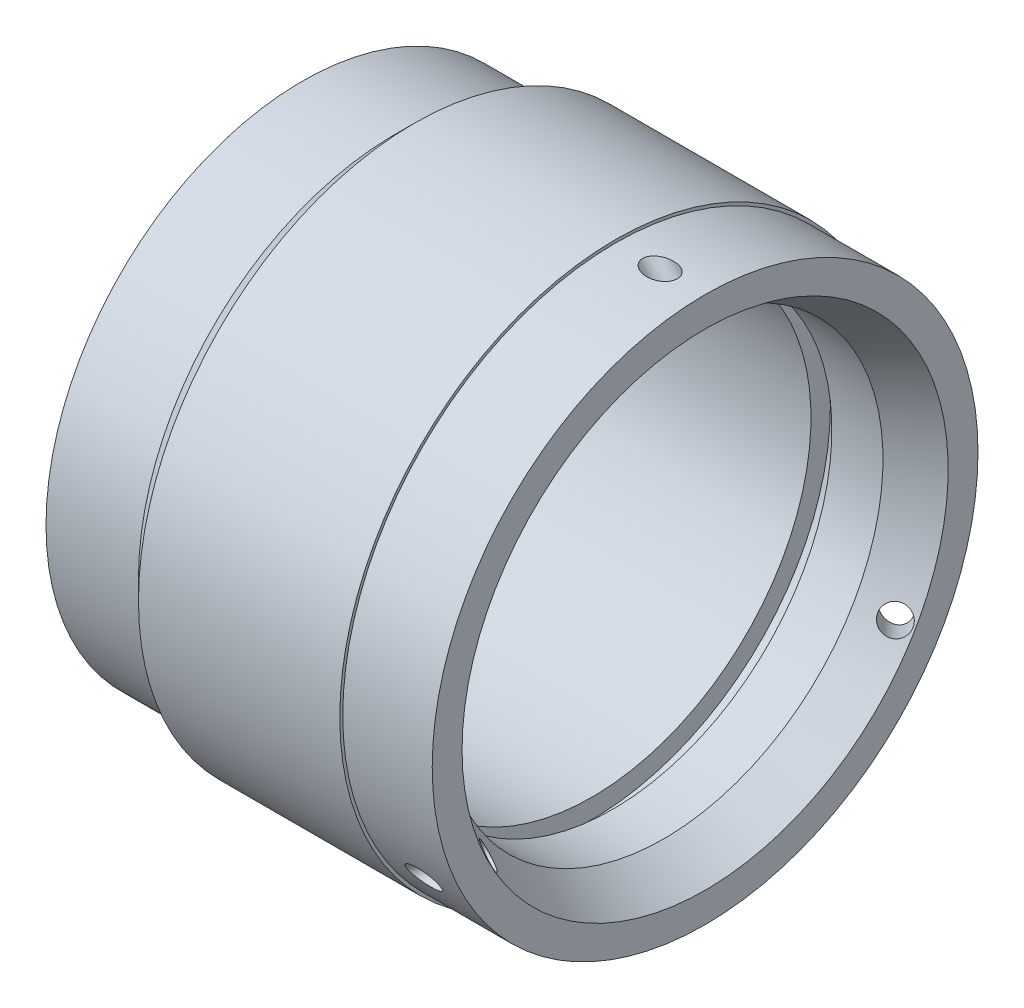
from build123d import *

# Parameters (mm, degrees)
ESQUISSE4_R                  = 0.45
EXTRUSION1_DEPTH             = 24.001629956
R_P_TITION_CIRCULAIRE1_COUNT = 3


with BuildPart() as part:
    # Esquisse1 → R_volution1 (revolve)
    with BuildSketch(Plane.XY, mode=Mode.PRIVATE) as r_volution1_sk:
        Polygon((0, 8.6), (0, 8.05), (0.4, 8.05), (0.804145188, 7.35), (9.7, 7.35), (9.7, 8), (10.4, 8), (10.4, 7.35), (12.114359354, 7.35), (13.5, 8.15), (13.5, 9.15), (10.5, 9.15), (10.5, 9.25), (3.75, 9.25), (3.1, 8.6), align=None)
    revolve(r_volution1_sk.sketch.rotate(Axis((0, 0, 0), (1, 0, 0)), 90), axis=Axis((0, 0, 0), (1, 0, 0)))

    # Esquisse4 → Extrusion1 (cut, through all)
    with BuildSketch(Plane(origin=(15.183900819, 5.34320515, 0), x_dir=(0, 0, -1), z_dir=(0.6427876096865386, -0.7660444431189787, 0))):
        with Locations(Location((0, 0, 0), (0, 0, 90))):
            Circle(ESQUISSE4_R)
    extrusion1 = extrude(amount=-EXTRUSION1_DEPTH, mode=Mode.SUBTRACT)

    # R_p_tition circulaire1: Extrusion1 ×3 about axis
    r_p_tition_circulaire1_axis = Axis((0, 0, 0), (-1, 0, 0))
    for i in range(1, R_P_TITION_CIRCULAIRE1_COUNT):
        add(extrusion1.rotate(r_p_tition_circulaire1_axis, i * 360 / R_P_TITION_CIRCULAIRE1_COUNT), mode=Mode.SUBTRACT)


solid = part.part
